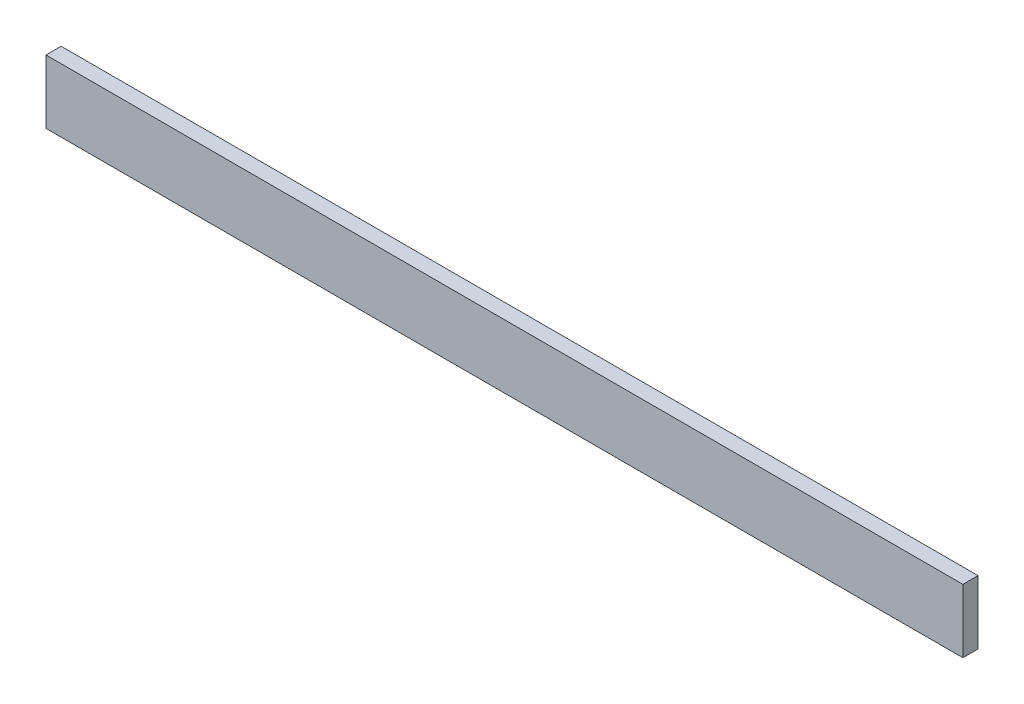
ISO-10303-21;
HEADER;
FILE_DESCRIPTION(('STEP AP214'),'2;1');
FILE_NAME('part.step','',(''),(''),'','','');
FILE_SCHEMA(('AUTOMOTIVE_DESIGN { 1 0 10303 214 1 1 1 1 }'));
ENDSEC;
DATA;
#1=APPLICATION_CONTEXT('core data for automotive mechanical design processes');
#2=APPLICATION_PROTOCOL_DEFINITION('international standard','automotive_design',2000,#1);
#3=PRODUCT_CONTEXT('',#1,'mechanical');
#4=PRODUCT('Part','Part','',(#3));
#5=PRODUCT_RELATED_PRODUCT_CATEGORY('part','',(#4));
#6=PRODUCT_DEFINITION_FORMATION('','',#4);
#7=PRODUCT_DEFINITION_CONTEXT('part definition',#1,'design');
#8=PRODUCT_DEFINITION('design','',#6,#7);
#9=PRODUCT_DEFINITION_SHAPE('','',#8);
#10=(LENGTH_UNIT() NAMED_UNIT(*) SI_UNIT(.MILLI.,.METRE.));
#11=(NAMED_UNIT(*) PLANE_ANGLE_UNIT() SI_UNIT($,.RADIAN.));
#12=(NAMED_UNIT(*) SI_UNIT($,.STERADIAN.) SOLID_ANGLE_UNIT());
#13=UNCERTAINTY_MEASURE_WITH_UNIT(LENGTH_MEASURE(1.E-05),#10,'distance_accuracy_value','');
#14=(GEOMETRIC_REPRESENTATION_CONTEXT(3) GLOBAL_UNCERTAINTY_ASSIGNED_CONTEXT((#13)) GLOBAL_UNIT_ASSIGNED_CONTEXT((#10,
#11,#12)) REPRESENTATION_CONTEXT('',''));
#15=CARTESIAN_POINT('',(0.,0.,0.));
#16=DIRECTION('',(0.,0.,1.));
#17=DIRECTION('',(1.,0.,0.));
#18=AXIS2_PLACEMENT_3D('',#15,#16,#17);
#19=CARTESIAN_POINT('',(-78.7477572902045,22.1579896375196,19.05));
#20=DIRECTION('',(1.,0.,0.));
#21=DIRECTION('',(0.,1.,0.));
#22=AXIS2_PLACEMENT_3D('',#19,#20,#21);
#23=PLANE('',#22);
#24=DIRECTION('',(0.,-1.,0.));
#25=VECTOR('',#24,1.);
#26=CARTESIAN_POINT('',(-78.7477572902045,22.1579896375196,0.));
#27=LINE('',#26,#25);
#28=CARTESIAN_POINT('',(-78.7477572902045,22.1579896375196,0.));
#29=VERTEX_POINT('',#28);
#30=CARTESIAN_POINT('',(-78.7477572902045,-57.8420103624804,0.));
#31=VERTEX_POINT('',#30);
#32=EDGE_CURVE('E94',#29,#31,#27,.T.);
#33=ORIENTED_EDGE('',*,*,#32,.T.);
#34=DIRECTION('',(0.,0.,-1.));
#35=VECTOR('',#34,1.);
#36=CARTESIAN_POINT('',(-78.7477572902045,-57.8420103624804,19.05));
#37=LINE('',#36,#35);
#38=CARTESIAN_POINT('',(-78.7477572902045,-57.8420103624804,19.05));
#39=VERTEX_POINT('',#38);
#40=EDGE_CURVE('E11',#39,#31,#37,.T.);
#41=ORIENTED_EDGE('',*,*,#40,.F.);
#42=DIRECTION('',(0.,-1.,0.));
#43=VECTOR('',#42,1.);
#44=CARTESIAN_POINT('',(-78.7477572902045,22.1579896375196,19.05));
#45=LINE('',#44,#43);
#46=CARTESIAN_POINT('',(-78.7477572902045,22.1579896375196,19.05));
#47=VERTEX_POINT('',#46);
#48=EDGE_CURVE('E82',#47,#39,#45,.T.);
#49=ORIENTED_EDGE('',*,*,#48,.F.);
#50=DIRECTION('',(0.,0.,-1.));
#51=VECTOR('',#50,1.);
#52=CARTESIAN_POINT('',(-78.7477572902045,22.1579896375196,19.05));
#53=LINE('',#52,#51);
#54=EDGE_CURVE('E90',#47,#29,#53,.T.);
#55=ORIENTED_EDGE('',*,*,#54,.T.);
#56=EDGE_LOOP('',(#33,#41,#49,#55));
#57=FACE_BOUND('',#56,.T.);
#58=ADVANCED_FACE('F31',(#57),#23,.F.);
#59=CARTESIAN_POINT('',(-78.7477572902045,-57.8420103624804,19.05));
#60=DIRECTION('',(0.,1.,0.));
#61=DIRECTION('',(0.,0.,1.));
#62=AXIS2_PLACEMENT_3D('',#59,#60,#61);
#63=PLANE('',#62);
#64=DIRECTION('',(1.,0.,0.));
#65=VECTOR('',#64,1.);
#66=CARTESIAN_POINT('',(-78.7477572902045,-57.8420103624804,0.));
#67=LINE('',#66,#65);
#68=CARTESIAN_POINT('',(1075.0523227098,-57.8420103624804,0.));
#69=VERTEX_POINT('',#68);
#70=EDGE_CURVE('E86',#31,#69,#67,.T.);
#71=ORIENTED_EDGE('',*,*,#70,.T.);
#72=DIRECTION('',(0.,0.,-1.));
#73=VECTOR('',#72,1.);
#74=CARTESIAN_POINT('',(1075.0523227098,-57.8420103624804,19.05));
#75=LINE('',#74,#73);
#76=CARTESIAN_POINT('',(1075.0523227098,-57.8420103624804,19.05));
#77=VERTEX_POINT('',#76);
#78=EDGE_CURVE('E39',#77,#69,#75,.T.);
#79=ORIENTED_EDGE('',*,*,#78,.F.);
#80=DIRECTION('',(1.,0.,0.));
#81=VECTOR('',#80,1.);
#82=CARTESIAN_POINT('',(-78.7477572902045,-57.8420103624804,19.05));
#83=LINE('',#82,#81);
#84=EDGE_CURVE('E77',#39,#77,#83,.T.);
#85=ORIENTED_EDGE('',*,*,#84,.F.);
#86=ORIENTED_EDGE('',*,*,#40,.T.);
#87=EDGE_LOOP('',(#71,#79,#85,#86));
#88=FACE_BOUND('',#87,.T.);
#89=ADVANCED_FACE('F85',(#88),#63,.F.);
#90=CARTESIAN_POINT('',(1075.0523227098,22.1579896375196,19.05));
#91=DIRECTION('',(-1.,0.,0.));
#92=DIRECTION('',(0.,0.,1.));
#93=AXIS2_PLACEMENT_3D('',#90,#91,#92);
#94=PLANE('',#93);
#95=DIRECTION('',(0.,1.,0.));
#96=VECTOR('',#95,1.);
#97=CARTESIAN_POINT('',(1075.0523227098,22.1579896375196,0.));
#98=LINE('',#97,#96);
#99=CARTESIAN_POINT('',(1075.0523227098,22.1579896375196,0.));
#100=VERTEX_POINT('',#99);
#101=EDGE_CURVE('E64',#69,#100,#98,.T.);
#102=ORIENTED_EDGE('',*,*,#101,.T.);
#103=DIRECTION('',(0.,0.,-1.));
#104=VECTOR('',#103,1.);
#105=CARTESIAN_POINT('',(1075.0523227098,22.1579896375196,19.05));
#106=LINE('',#105,#104);
#107=CARTESIAN_POINT('',(1075.0523227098,22.1579896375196,19.05));
#108=VERTEX_POINT('',#107);
#109=EDGE_CURVE('E87',#108,#100,#106,.T.);
#110=ORIENTED_EDGE('',*,*,#109,.F.);
#111=DIRECTION('',(0.,1.,0.));
#112=VECTOR('',#111,1.);
#113=CARTESIAN_POINT('',(1075.0523227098,22.1579896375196,19.05));
#114=LINE('',#113,#112);
#115=EDGE_CURVE('E80',#77,#108,#114,.T.);
#116=ORIENTED_EDGE('',*,*,#115,.F.);
#117=ORIENTED_EDGE('',*,*,#78,.T.);
#118=EDGE_LOOP('',(#102,#110,#116,#117));
#119=FACE_BOUND('',#118,.T.);
#120=ADVANCED_FACE('F88',(#119),#94,.F.);
#121=CARTESIAN_POINT('',(-78.7477572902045,22.1579896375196,19.05));
#122=DIRECTION('',(0.,-1.,0.));
#123=DIRECTION('',(0.,0.,-1.));
#124=AXIS2_PLACEMENT_3D('',#121,#122,#123);
#125=PLANE('',#124);
#126=DIRECTION('',(-1.,0.,0.));
#127=VECTOR('',#126,1.);
#128=CARTESIAN_POINT('',(-78.7477572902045,22.1579896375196,0.));
#129=LINE('',#128,#127);
#130=EDGE_CURVE('E70',#100,#29,#129,.T.);
#131=ORIENTED_EDGE('',*,*,#130,.T.);
#132=ORIENTED_EDGE('',*,*,#54,.F.);
#133=DIRECTION('',(-1.,0.,0.));
#134=VECTOR('',#133,1.);
#135=CARTESIAN_POINT('',(-78.7477572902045,22.1579896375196,19.05));
#136=LINE('',#135,#134);
#137=EDGE_CURVE('E47',#108,#47,#136,.T.);
#138=ORIENTED_EDGE('',*,*,#137,.F.);
#139=ORIENTED_EDGE('',*,*,#109,.T.);
#140=EDGE_LOOP('',(#131,#132,#138,#139));
#141=FACE_BOUND('',#140,.T.);
#142=ADVANCED_FACE('F101',(#141),#125,.F.);
#143=CARTESIAN_POINT('',(-78.7477572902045,-57.8420103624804,19.05));
#144=DIRECTION('',(0.,0.,1.));
#145=DIRECTION('',(1.,0.,0.));
#146=AXIS2_PLACEMENT_3D('',#143,#144,#145);
#147=PLANE('',#146);
#148=ORIENTED_EDGE('',*,*,#48,.T.);
#149=ORIENTED_EDGE('',*,*,#84,.T.);
#150=ORIENTED_EDGE('',*,*,#115,.T.);
#151=ORIENTED_EDGE('',*,*,#137,.T.);
#152=EDGE_LOOP('',(#148,#149,#150,#151));
#153=FACE_BOUND('',#152,.T.);
#154=ADVANCED_FACE('F78',(#153),#147,.T.);
#155=CARTESIAN_POINT('',(-78.7477572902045,-57.8420103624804,0.));
#156=DIRECTION('',(0.,0.,1.));
#157=DIRECTION('',(1.,0.,0.));
#158=AXIS2_PLACEMENT_3D('',#155,#156,#157);
#159=PLANE('',#158);
#160=ORIENTED_EDGE('',*,*,#32,.F.);
#161=ORIENTED_EDGE('',*,*,#130,.F.);
#162=ORIENTED_EDGE('',*,*,#101,.F.);
#163=ORIENTED_EDGE('',*,*,#70,.F.);
#164=EDGE_LOOP('',(#160,#161,#162,#163));
#165=FACE_BOUND('',#164,.T.);
#166=ADVANCED_FACE('F104',(#165),#159,.F.);
#167=CLOSED_SHELL('',(#58,#89,#120,#142,#154,#166));
#168=MANIFOLD_SOLID_BREP('B2',#167);
#169=ADVANCED_BREP_SHAPE_REPRESENTATION('',(#18,#168),#14);
#170=SHAPE_DEFINITION_REPRESENTATION(#9,#169);
ENDSEC;
END-ISO-10303-21;
